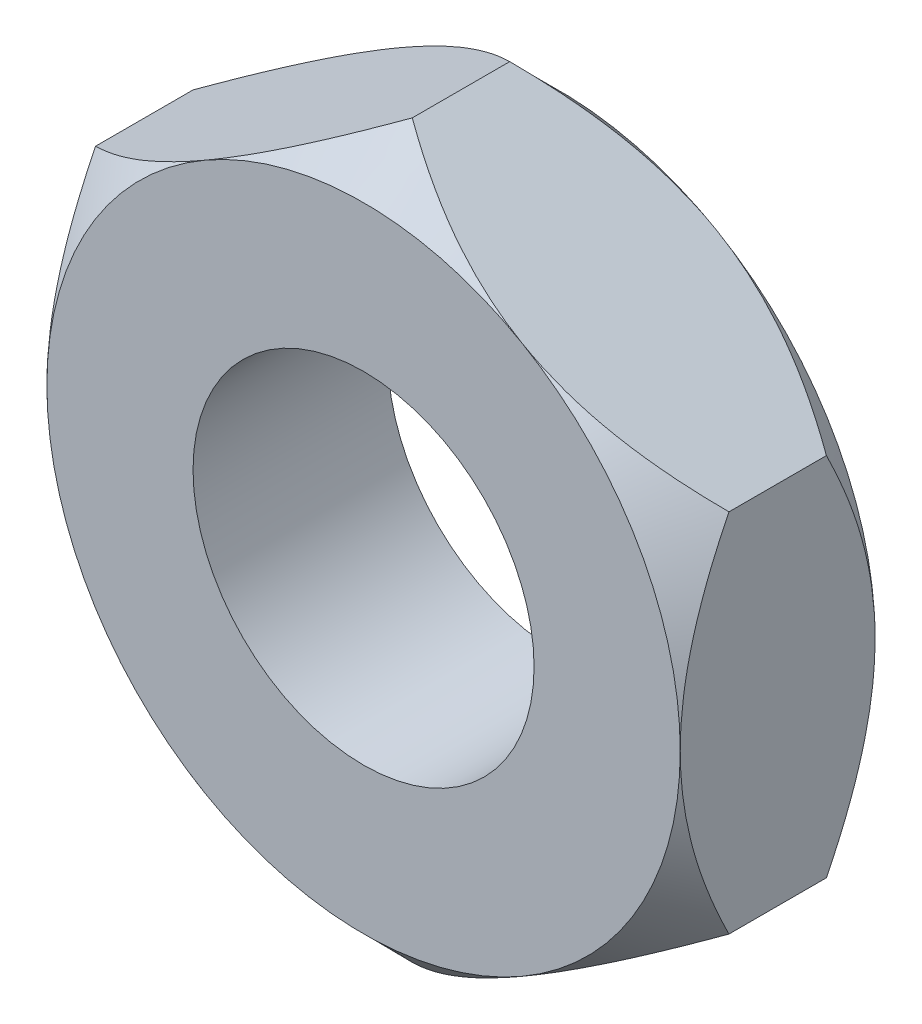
ISO-10303-21;
HEADER;
FILE_DESCRIPTION(('STEP AP214'),'2;1');
FILE_NAME('part.step','',(''),(''),'','','');
FILE_SCHEMA(('AUTOMOTIVE_DESIGN { 1 0 10303 214 1 1 1 1 }'));
ENDSEC;
DATA;
#1=APPLICATION_CONTEXT('core data for automotive mechanical design processes');
#2=APPLICATION_PROTOCOL_DEFINITION('international standard','automotive_design',2000,#1);
#3=PRODUCT_CONTEXT('',#1,'mechanical');
#4=PRODUCT('Part','Part','',(#3));
#5=PRODUCT_RELATED_PRODUCT_CATEGORY('part','',(#4));
#6=PRODUCT_DEFINITION_FORMATION('','',#4);
#7=PRODUCT_DEFINITION_CONTEXT('part definition',#1,'design');
#8=PRODUCT_DEFINITION('design','',#6,#7);
#9=PRODUCT_DEFINITION_SHAPE('','',#8);
#10=(LENGTH_UNIT() NAMED_UNIT(*) SI_UNIT(.MILLI.,.METRE.));
#11=(NAMED_UNIT(*) PLANE_ANGLE_UNIT() SI_UNIT($,.RADIAN.));
#12=(NAMED_UNIT(*) SI_UNIT($,.STERADIAN.) SOLID_ANGLE_UNIT());
#13=UNCERTAINTY_MEASURE_WITH_UNIT(LENGTH_MEASURE(1.E-05),#10,'distance_accuracy_value','');
#14=(GEOMETRIC_REPRESENTATION_CONTEXT(3) GLOBAL_UNCERTAINTY_ASSIGNED_CONTEXT((#13)) GLOBAL_UNIT_ASSIGNED_CONTEXT((#10,
#11,#12)) REPRESENTATION_CONTEXT('',''));
#15=CARTESIAN_POINT('',(0.,0.,0.));
#16=DIRECTION('',(0.,0.,1.));
#17=DIRECTION('',(1.,0.,0.));
#18=AXIS2_PLACEMENT_3D('',#15,#16,#17);
#19=CARTESIAN_POINT('',(6.5,3.75277674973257,2.));
#20=DIRECTION('',(-0.5,-0.866025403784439,0.));
#21=DIRECTION('',(0.866025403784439,-0.5,0.));
#22=AXIS2_PLACEMENT_3D('',#19,#20,#21);
#23=PLANE('',#22);
#24=DIRECTION('',(0.,0.,-1.));
#25=VECTOR('',#24,1.);
#26=CARTESIAN_POINT('',(6.5,3.75277674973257,2.));
#27=LINE('',#26,#25);
#28=CARTESIAN_POINT('',(6.5,3.75277674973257,1.));
#29=VERTEX_POINT('',#28);
#30=CARTESIAN_POINT('',(6.5,3.75277674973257,-1.));
#31=VERTEX_POINT('',#30);
#32=EDGE_CURVE('E275',#29,#31,#27,.T.);
#33=ORIENTED_EDGE('',*,*,#32,.T.);
#34=CARTESIAN_POINT('',(6.5002,3.75266127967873,-0.999885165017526));
#35=CARTESIAN_POINT('',(6.3879001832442,3.81749760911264,-1.06435666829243));
#36=CARTESIAN_POINT('',(6.27474067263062,3.88283028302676,-1.12683571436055));
#37=CARTESIAN_POINT('',(6.04653388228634,4.01458553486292,-1.24720232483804));
#38=CARTESIAN_POINT('',(5.93148560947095,4.0810086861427,-1.30508737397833));
#39=CARTESIAN_POINT('',(5.58219198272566,4.2826734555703,-1.47143225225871));
#40=CARTESIAN_POINT('',(5.34500354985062,4.41961426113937,-1.57187411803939));
#41=CARTESIAN_POINT('',(4.86676947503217,4.69572283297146,-1.74362379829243));
#42=CARTESIAN_POINT('',(4.62584589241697,4.83482012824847,-1.81537119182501));
#43=CARTESIAN_POINT('',(4.26055521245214,5.04572080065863,-1.89809574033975));
#44=CARTESIAN_POINT('',(4.13826265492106,5.11632644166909,-1.92151035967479));
#45=CARTESIAN_POINT('',(3.89266238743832,5.25812382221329,-1.95950957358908));
#46=CARTESIAN_POINT('',(3.76935482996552,5.32931547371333,-1.97409547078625));
#47=CARTESIAN_POINT('',(3.46824490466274,5.50316137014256,-1.99833324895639));
#48=CARTESIAN_POINT('',(3.29012533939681,5.60599874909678,-2.00306042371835));
#49=CARTESIAN_POINT('',(2.93425395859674,5.81146118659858,-1.99306594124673));
#50=CARTESIAN_POINT('',(2.75650229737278,5.91408615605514,-1.97833732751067));
#51=CARTESIAN_POINT('',(2.40271978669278,6.11834258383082,-1.93030561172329));
#52=CARTESIAN_POINT('',(2.22669109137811,6.21997279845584,-1.8969816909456));
#53=CARTESIAN_POINT('',(1.87769250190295,6.42146722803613,-1.81357720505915));
#54=CARTESIAN_POINT('',(1.70472236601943,6.52133158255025,-1.76349797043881));
#55=CARTESIAN_POINT('',(1.40102497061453,6.69667135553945,-1.66178988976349));
#56=CARTESIAN_POINT('',(1.26955769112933,6.77257402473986,-1.61305038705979));
#57=CARTESIAN_POINT('',(1.00892829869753,6.92304847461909,-1.50797082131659));
#58=CARTESIAN_POINT('',(0.879766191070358,6.99762025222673,-1.4516307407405));
#59=CARTESIAN_POINT('',(0.624163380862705,7.14519260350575,-1.33257010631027));
#60=CARTESIAN_POINT('',(0.497715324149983,7.21819742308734,-1.26987043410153));
#61=CARTESIAN_POINT('',(0.247093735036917,7.3628938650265,-1.13886515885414));
#62=CARTESIAN_POINT('',(0.122919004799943,7.43458617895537,-1.07056261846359));
#63=CARTESIAN_POINT('',(-0.000199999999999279,7.50566896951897,-0.999885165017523));
#64=B_SPLINE_CURVE_WITH_KNOTS('',3,(#34,#35,#36,#37,#38,#39,#40,#41,#42,#43,#44,#45,#46,#47,#48,
#49,#50,#51,#52,#53,#54,#55,#56,#57,#58,#59,#60,#61,#62,#63),.UNSPECIFIED.,.F.,.F.,(4,2,2,2,2,2,
2,2,2,2,2,2,2,2,4),(0.,0.434421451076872,0.86907913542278,1.74306808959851,2.60310196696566,
3.03227761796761,3.46138993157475,4.07761355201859,4.69405756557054,5.31119311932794,
5.9282796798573,6.40638297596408,6.88448737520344,7.36106984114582,7.8373935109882),.UNSPECIFIED.);
#65=CARTESIAN_POINT('',(3.25,5.62916512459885,-2.));
#66=VERTEX_POINT('',#65);
#67=EDGE_CURVE('E53',#31,#66,#64,.T.);
#68=ORIENTED_EDGE('',*,*,#67,.T.);
#69=CARTESIAN_POINT('',(0.,7.50555349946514,-1.));
#70=VERTEX_POINT('',#69);
#71=EDGE_CURVE('E268',#66,#70,#64,.T.);
#72=ORIENTED_EDGE('',*,*,#71,.T.);
#73=DIRECTION('',(0.,0.,-1.));
#74=VECTOR('',#73,1.);
#75=CARTESIAN_POINT('',(0.,7.50555349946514,2.));
#76=LINE('',#75,#74);
#77=CARTESIAN_POINT('',(0.,7.50555349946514,1.));
#78=VERTEX_POINT('',#77);
#79=EDGE_CURVE('E147',#78,#70,#76,.T.);
#80=ORIENTED_EDGE('',*,*,#79,.F.);
#81=CARTESIAN_POINT('',(-0.000199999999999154,7.50566896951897,0.999885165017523));
#82=CARTESIAN_POINT('',(0.112099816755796,7.44083264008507,1.06435666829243));
#83=CARTESIAN_POINT('',(0.225259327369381,7.37549996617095,1.12683571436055));
#84=CARTESIAN_POINT('',(0.453466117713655,7.24374471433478,1.24720232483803));
#85=CARTESIAN_POINT('',(0.568514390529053,7.17732156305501,1.30508737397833));
#86=CARTESIAN_POINT('',(0.917808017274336,6.9756567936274,1.47143225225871));
#87=CARTESIAN_POINT('',(1.15499645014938,6.83871598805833,1.57187411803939));
#88=CARTESIAN_POINT('',(1.63323052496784,6.56260741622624,1.74362379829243));
#89=CARTESIAN_POINT('',(1.87415410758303,6.42351012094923,1.81537119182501));
#90=CARTESIAN_POINT('',(2.23944478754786,6.21260944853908,1.89809574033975));
#91=CARTESIAN_POINT('',(2.36173734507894,6.14200380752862,1.9215103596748));
#92=CARTESIAN_POINT('',(2.60733761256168,6.00020642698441,1.95950957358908));
#93=CARTESIAN_POINT('',(2.73064517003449,5.92901477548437,1.97409547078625));
#94=CARTESIAN_POINT('',(3.03175509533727,5.75516887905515,1.99833324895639));
#95=CARTESIAN_POINT('',(3.2098746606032,5.65233150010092,2.00306042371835));
#96=CARTESIAN_POINT('',(3.56574604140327,5.44686906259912,1.99306594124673));
#97=CARTESIAN_POINT('',(3.74349770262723,5.34424409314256,1.97833732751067));
#98=CARTESIAN_POINT('',(4.09728021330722,5.13998766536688,1.93030561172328));
#99=CARTESIAN_POINT('',(4.2733089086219,5.03835745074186,1.8969816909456));
#100=CARTESIAN_POINT('',(4.62230749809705,4.83686302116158,1.81357720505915));
#101=CARTESIAN_POINT('',(4.79527763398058,4.73699866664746,1.76349797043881));
#102=CARTESIAN_POINT('',(5.09897502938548,4.56165889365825,1.66178988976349));
#103=CARTESIAN_POINT('',(5.23044230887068,4.48575622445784,1.61305038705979));
#104=CARTESIAN_POINT('',(5.49107170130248,4.33528177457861,1.50797082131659));
#105=CARTESIAN_POINT('',(5.62023380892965,4.26070999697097,1.4516307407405));
#106=CARTESIAN_POINT('',(5.8758366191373,4.11313764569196,1.33257010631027));
#107=CARTESIAN_POINT('',(6.00228467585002,4.04013282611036,1.26987043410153));
#108=CARTESIAN_POINT('',(6.25290626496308,3.8954363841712,1.13886515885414));
#109=CARTESIAN_POINT('',(6.37708099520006,3.82374407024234,1.0705626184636));
#110=CARTESIAN_POINT('',(6.5002,3.75266127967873,0.999885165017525));
#111=B_SPLINE_CURVE_WITH_KNOTS('',3,(#81,#82,#83,#84,#85,#86,#87,#88,#89,#90,#91,#92,#93,#94,
#95,#96,#97,#98,#99,#100,#101,#102,#103,#104,#105,#106,#107,#108,#109,#110),.UNSPECIFIED.,.F.,
.F.,(4,2,2,2,2,2,2,2,2,2,2,2,2,2,4),(0.,0.434421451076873,0.869079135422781,1.74306808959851,
2.60310196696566,3.03227761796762,3.46138993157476,4.0776135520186,4.69405756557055,
5.31119311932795,5.92827967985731,6.40638297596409,6.88448737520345,7.36106984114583,
7.8373935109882),.UNSPECIFIED.);
#112=CARTESIAN_POINT('',(3.25,5.62916512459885,2.));
#113=VERTEX_POINT('',#112);
#114=EDGE_CURVE('E183',#78,#113,#111,.T.);
#115=ORIENTED_EDGE('',*,*,#114,.T.);
#116=EDGE_CURVE('E191',#113,#29,#111,.T.);
#117=ORIENTED_EDGE('',*,*,#116,.T.);
#118=EDGE_LOOP('',(#33,#68,#72,#80,#115,#117));
#119=FACE_BOUND('',#118,.T.);
#120=ADVANCED_FACE('F31',(#119),#23,.F.);
#121=CARTESIAN_POINT('',(0.,7.50555349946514,2.));
#122=DIRECTION('',(0.5,-0.866025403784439,0.));
#123=DIRECTION('',(0.866025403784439,0.5,0.));
#124=AXIS2_PLACEMENT_3D('',#121,#122,#123);
#125=PLANE('',#124);
#126=ORIENTED_EDGE('',*,*,#79,.T.);
#127=CARTESIAN_POINT('',(0.000200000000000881,7.50566896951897,-0.999885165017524));
#128=CARTESIAN_POINT('',(-0.112099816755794,7.44083264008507,-1.06435666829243));
#129=CARTESIAN_POINT('',(-0.225259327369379,7.37549996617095,-1.12683571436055));
#130=CARTESIAN_POINT('',(-0.453466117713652,7.24374471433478,-1.24720232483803));
#131=CARTESIAN_POINT('',(-0.568514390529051,7.17732156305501,-1.30508737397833));
#132=CARTESIAN_POINT('',(-0.917808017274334,6.9756567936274,-1.4714322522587));
#133=CARTESIAN_POINT('',(-1.15499645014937,6.83871598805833,-1.57187411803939));
#134=CARTESIAN_POINT('',(-1.63323052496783,6.56260741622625,-1.74362379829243));
#135=CARTESIAN_POINT('',(-1.87415410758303,6.42351012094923,-1.81537119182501));
#136=CARTESIAN_POINT('',(-2.23944478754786,6.21260944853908,-1.89809574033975));
#137=CARTESIAN_POINT('',(-2.36173734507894,6.14200380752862,-1.92151035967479));
#138=CARTESIAN_POINT('',(-2.60733761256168,6.00020642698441,-1.95950957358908));
#139=CARTESIAN_POINT('',(-2.73064517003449,5.92901477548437,-1.97409547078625));
#140=CARTESIAN_POINT('',(-3.03175509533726,5.75516887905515,-1.99833324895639));
#141=CARTESIAN_POINT('',(-3.20987466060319,5.65233150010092,-2.00306042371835));
#142=CARTESIAN_POINT('',(-3.56574604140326,5.44686906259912,-1.99306594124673));
#143=CARTESIAN_POINT('',(-3.74349770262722,5.34424409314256,-1.97833732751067));
#144=CARTESIAN_POINT('',(-4.09728021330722,5.13998766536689,-1.93030561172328));
#145=CARTESIAN_POINT('',(-4.27330890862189,5.03835745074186,-1.8969816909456));
#146=CARTESIAN_POINT('',(-4.62230749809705,4.83686302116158,-1.81357720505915));
#147=CARTESIAN_POINT('',(-4.79527763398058,4.73699866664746,-1.76349797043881));
#148=CARTESIAN_POINT('',(-5.09897502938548,4.56165889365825,-1.66178988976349));
#149=CARTESIAN_POINT('',(-5.23044230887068,4.48575622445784,-1.61305038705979));
#150=CARTESIAN_POINT('',(-5.49107170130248,4.33528177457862,-1.50797082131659));
#151=CARTESIAN_POINT('',(-5.62023380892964,4.26070999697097,-1.4516307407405));
#152=CARTESIAN_POINT('',(-5.8758366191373,4.11313764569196,-1.33257010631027));
#153=CARTESIAN_POINT('',(-6.00228467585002,4.04013282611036,-1.26987043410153));
#154=CARTESIAN_POINT('',(-6.25290626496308,3.8954363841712,-1.13886515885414));
#155=CARTESIAN_POINT('',(-6.37708099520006,3.82374407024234,-1.0705626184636));
#156=CARTESIAN_POINT('',(-6.5002,3.75266127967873,-0.999885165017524));
#157=B_SPLINE_CURVE_WITH_KNOTS('',3,(#127,#128,#129,#130,#131,#132,#133,#134,#135,#136,#137,
#138,#139,#140,#141,#142,#143,#144,#145,#146,#147,#148,#149,#150,#151,#152,#153,#154,#155,#156),
.UNSPECIFIED.,.F.,.F.,(4,2,2,2,2,2,2,2,2,2,2,2,2,2,4),(0.,0.434421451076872,0.869079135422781,
1.74306808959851,2.60310196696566,3.03227761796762,3.46138993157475,4.0776135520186,
4.69405756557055,5.31119311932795,5.92827967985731,6.40638297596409,6.88448737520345,
7.36106984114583,7.8373935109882),.UNSPECIFIED.);
#158=CARTESIAN_POINT('',(-3.25,5.62916512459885,-2.));
#159=VERTEX_POINT('',#158);
#160=EDGE_CURVE('E141',#70,#159,#157,.T.);
#161=ORIENTED_EDGE('',*,*,#160,.T.);
#162=CARTESIAN_POINT('',(-6.5,3.75277674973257,-1.));
#163=VERTEX_POINT('',#162);
#164=EDGE_CURVE('E124',#159,#163,#157,.T.);
#165=ORIENTED_EDGE('',*,*,#164,.T.);
#166=DIRECTION('',(0.,0.,-1.));
#167=VECTOR('',#166,1.);
#168=CARTESIAN_POINT('',(-6.5,3.75277674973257,2.));
#169=LINE('',#168,#167);
#170=CARTESIAN_POINT('',(-6.5,3.75277674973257,1.));
#171=VERTEX_POINT('',#170);
#172=EDGE_CURVE('E140',#171,#163,#169,.T.);
#173=ORIENTED_EDGE('',*,*,#172,.F.);
#174=CARTESIAN_POINT('',(-6.5002,3.75266127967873,0.999885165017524));
#175=CARTESIAN_POINT('',(-6.3879001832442,3.81749760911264,1.06435666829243));
#176=CARTESIAN_POINT('',(-6.27474067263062,3.88283028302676,1.12683571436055));
#177=CARTESIAN_POINT('',(-6.04653388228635,4.01458553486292,1.24720232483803));
#178=CARTESIAN_POINT('',(-5.93148560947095,4.08100868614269,1.30508737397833));
#179=CARTESIAN_POINT('',(-5.58219198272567,4.2826734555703,1.47143225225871));
#180=CARTESIAN_POINT('',(-5.34500354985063,4.41961426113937,1.57187411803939));
#181=CARTESIAN_POINT('',(-4.86676947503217,4.69572283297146,1.74362379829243));
#182=CARTESIAN_POINT('',(-4.62584589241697,4.83482012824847,1.81537119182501));
#183=CARTESIAN_POINT('',(-4.26055521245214,5.04572080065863,1.89809574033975));
#184=CARTESIAN_POINT('',(-4.13826265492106,5.11632644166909,1.9215103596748));
#185=CARTESIAN_POINT('',(-3.89266238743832,5.25812382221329,1.95950957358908));
#186=CARTESIAN_POINT('',(-3.76935482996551,5.32931547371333,1.97409547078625));
#187=CARTESIAN_POINT('',(-3.46824490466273,5.50316137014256,1.99833324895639));
#188=CARTESIAN_POINT('',(-3.2901253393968,5.60599874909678,2.00306042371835));
#189=CARTESIAN_POINT('',(-2.93425395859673,5.81146118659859,1.99306594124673));
#190=CARTESIAN_POINT('',(-2.75650229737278,5.91408615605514,1.97833732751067));
#191=CARTESIAN_POINT('',(-2.40271978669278,6.11834258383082,1.93030561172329));
#192=CARTESIAN_POINT('',(-2.2266910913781,6.21997279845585,1.8969816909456));
#193=CARTESIAN_POINT('',(-1.87769250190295,6.42146722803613,1.81357720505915));
#194=CARTESIAN_POINT('',(-1.70472236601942,6.52133158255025,1.76349797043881));
#195=CARTESIAN_POINT('',(-1.40102497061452,6.69667135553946,1.66178988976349));
#196=CARTESIAN_POINT('',(-1.26955769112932,6.77257402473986,1.61305038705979));
#197=CARTESIAN_POINT('',(-1.00892829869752,6.92304847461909,1.50797082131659));
#198=CARTESIAN_POINT('',(-0.879766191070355,6.99762025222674,1.4516307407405));
#199=CARTESIAN_POINT('',(-0.624163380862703,7.14519260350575,1.33257010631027));
#200=CARTESIAN_POINT('',(-0.497715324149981,7.21819742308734,1.26987043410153));
#201=CARTESIAN_POINT('',(-0.247093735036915,7.3628938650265,1.13886515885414));
#202=CARTESIAN_POINT('',(-0.122919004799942,7.43458617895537,1.0705626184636));
#203=CARTESIAN_POINT('',(0.000200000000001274,7.50566896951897,0.999885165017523));
#204=B_SPLINE_CURVE_WITH_KNOTS('',3,(#174,#175,#176,#177,#178,#179,#180,#181,#182,#183,#184,
#185,#186,#187,#188,#189,#190,#191,#192,#193,#194,#195,#196,#197,#198,#199,#200,#201,#202,#203),
.UNSPECIFIED.,.F.,.F.,(4,2,2,2,2,2,2,2,2,2,2,2,2,2,4),(0.,0.434421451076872,0.86907913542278,
1.74306808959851,2.60310196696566,3.03227761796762,3.46138993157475,4.0776135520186,
4.69405756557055,5.31119311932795,5.92827967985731,6.40638297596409,6.88448737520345,
7.36106984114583,7.8373935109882),.UNSPECIFIED.);
#205=CARTESIAN_POINT('',(-3.25,5.62916512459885,2.));
#206=VERTEX_POINT('',#205);
#207=EDGE_CURVE('E250',#171,#206,#204,.T.);
#208=ORIENTED_EDGE('',*,*,#207,.T.);
#209=EDGE_CURVE('E185',#206,#78,#204,.T.);
#210=ORIENTED_EDGE('',*,*,#209,.T.);
#211=EDGE_LOOP('',(#126,#161,#165,#173,#208,#210));
#212=FACE_BOUND('',#211,.T.);
#213=ADVANCED_FACE('F138',(#212),#125,.F.);
#214=CARTESIAN_POINT('',(-6.5,3.75277674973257,2.));
#215=DIRECTION('',(1.,0.,0.));
#216=DIRECTION('',(0.,0.,-1.));
#217=AXIS2_PLACEMENT_3D('',#214,#215,#216);
#218=PLANE('',#217);
#219=ORIENTED_EDGE('',*,*,#172,.T.);
#220=CARTESIAN_POINT('',(-6.5,-7.84762752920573,1.66957966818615));
#221=CARTESIAN_POINT('',(-6.5,-7.65771219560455,1.52416000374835));
#222=CARTESIAN_POINT('',(-6.5,-7.46678035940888,1.38004698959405));
#223=CARTESIAN_POINT('',(-6.5,-7.08246758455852,1.09503196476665));
#224=CARTESIAN_POINT('',(-6.5,-6.88908607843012,0.954130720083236));
#225=CARTESIAN_POINT('',(-6.5,-6.49804934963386,0.67513753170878));
#226=CARTESIAN_POINT('',(-6.5,-6.30037269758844,0.537075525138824));
#227=CARTESIAN_POINT('',(-6.5,-5.90174946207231,0.265771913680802));
#228=CARTESIAN_POINT('',(-6.5,-5.70080310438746,0.13252997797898));
#229=CARTESIAN_POINT('',(-6.5,-5.28229584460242,-0.136252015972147));
#230=CARTESIAN_POINT('',(-6.5,-5.0644863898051,-0.271407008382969));
#231=CARTESIAN_POINT('',(-6.5,-4.62378439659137,-0.533300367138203));
#232=CARTESIAN_POINT('',(-6.5,-4.40089101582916,-0.660037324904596));
#233=CARTESIAN_POINT('',(-6.5,-3.94996330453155,-0.902390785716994));
#234=CARTESIAN_POINT('',(-6.5,-3.72194658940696,-1.01803980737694));
#235=CARTESIAN_POINT('',(-6.5,-3.25951036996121,-1.23561766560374));
#236=CARTESIAN_POINT('',(-6.5,-3.02509393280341,-1.33755294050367));
#237=CARTESIAN_POINT('',(-6.5,-2.57217264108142,-1.51505823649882));
#238=CARTESIAN_POINT('',(-6.5,-2.35429778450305,-1.59221921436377));
#239=CARTESIAN_POINT('',(-6.5,-1.91302782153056,-1.72907695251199));
#240=CARTESIAN_POINT('',(-6.5,-1.68963238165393,-1.788772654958));
#241=CARTESIAN_POINT('',(-6.5,-1.24255222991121,-1.88645277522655));
#242=CARTESIAN_POINT('',(-6.5,-1.01895512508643,-1.92483138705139));
#243=CARTESIAN_POINT('',(-6.5,-0.56903124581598,-1.97907291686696));
#244=CARTESIAN_POINT('',(-6.5,-0.342705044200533,-1.99494047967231));
#245=CARTESIAN_POINT('',(-6.5,0.100240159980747,-2.00281493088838));
#246=CARTESIAN_POINT('',(-6.5,0.316841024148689,-1.99585632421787));
#247=CARTESIAN_POINT('',(-6.5,0.74831610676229,-1.9608203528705));
#248=CARTESIAN_POINT('',(-6.5,0.963190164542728,-1.93274104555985));
#249=CARTESIAN_POINT('',(-6.5,1.39333005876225,-1.85657178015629));
#250=CARTESIAN_POINT('',(-6.5,1.60853208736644,-1.8081275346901));
#251=CARTESIAN_POINT('',(-6.5,2.03419827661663,-1.69391623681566));
#252=CARTESIAN_POINT('',(-6.5,2.24466272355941,-1.62815023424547));
#253=CARTESIAN_POINT('',(-6.5,2.67496760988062,-1.47708595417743));
#254=CARTESIAN_POINT('',(-6.5,2.89443797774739,-1.39074519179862));
#255=CARTESIAN_POINT('',(-6.5,3.32770458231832,-1.20473169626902));
#256=CARTESIAN_POINT('',(-6.5,3.54149815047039,-1.10505282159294));
#257=CARTESIAN_POINT('',(-6.5,3.96444622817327,-0.894752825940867));
#258=CARTESIAN_POINT('',(-6.5,4.17358364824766,-0.784097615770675));
#259=CARTESIAN_POINT('',(-6.5,4.58706793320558,-0.554299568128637));
#260=CARTESIAN_POINT('',(-6.5,4.7914155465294,-0.435158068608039));
#261=CARTESIAN_POINT('',(-6.5,5.18581138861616,-0.196207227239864));
#262=CARTESIAN_POINT('',(-6.5,5.37606267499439,-0.0767312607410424));
#263=CARTESIAN_POINT('',(-6.5,5.753317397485,0.167257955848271));
#264=CARTESIAN_POINT('',(-6.5,5.94032058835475,0.291771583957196));
#265=CARTESIAN_POINT('',(-6.5,6.30999252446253,0.543908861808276));
#266=CARTESIAN_POINT('',(-6.5,6.49268411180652,0.671499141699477));
#267=CARTESIAN_POINT('',(-6.5,6.85558623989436,0.93006071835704));
#268=CARTESIAN_POINT('',(-6.5,7.03579744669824,1.06103107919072));
#269=CARTESIAN_POINT('',(-6.5,7.2149704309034,1.19338280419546));
#270=B_SPLINE_CURVE_WITH_KNOTS('',3,(#220,#221,#222,#223,#224,#225,#226,#227,#228,#229,#230,
#231,#232,#233,#234,#235,#236,#237,#238,#239,#240,#241,#242,#243,#244,#245,#246,#247,#248,#249,
#250,#251,#252,#253,#254,#255,#256,#257,#258,#259,#260,#261,#262,#263,#264,#265,#266,#267,#268,
#269),.UNSPECIFIED.,.F.,.F.,(4,2,2,2,2,2,2,2,2,2,2,2,2,2,2,2,2,2,2,2,2,2,2,2,4),(0.,
0.717601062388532,1.43537151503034,2.15866180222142,2.88190235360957,3.65075745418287,
4.41974088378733,5.18639524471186,5.95268841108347,6.64549313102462,7.33833980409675,
8.01790723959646,8.69733443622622,9.34640220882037,9.99552968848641,10.656450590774,
11.3173314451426,12.0243128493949,12.7316209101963,13.4411988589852,14.1506651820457,
14.8245383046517,15.4984620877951,16.1669258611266,16.8352064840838),.UNSPECIFIED.);
#271=CARTESIAN_POINT('',(-6.5,0.,-2.));
#272=VERTEX_POINT('',#271);
#273=EDGE_CURVE('E121',#163,#272,#270,.F.);
#274=ORIENTED_EDGE('',*,*,#273,.T.);
#275=CARTESIAN_POINT('',(-6.5,-3.75277674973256,-1.));
#276=VERTEX_POINT('',#275);
#277=EDGE_CURVE('E132',#272,#276,#270,.F.);
#278=ORIENTED_EDGE('',*,*,#277,.T.);
#279=DIRECTION('',(0.,0.,-1.));
#280=VECTOR('',#279,1.);
#281=CARTESIAN_POINT('',(-6.5,-3.75277674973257,2.));
#282=LINE('',#281,#280);
#283=CARTESIAN_POINT('',(-6.5,-3.75277674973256,1.));
#284=VERTEX_POINT('',#283);
#285=EDGE_CURVE('E148',#284,#276,#282,.T.);
#286=ORIENTED_EDGE('',*,*,#285,.F.);
#287=CARTESIAN_POINT('',(-6.5,-7.84762752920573,-1.66957966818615));
#288=CARTESIAN_POINT('',(-6.5,-7.65771219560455,-1.52416000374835));
#289=CARTESIAN_POINT('',(-6.5,-7.46678035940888,-1.38004698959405));
#290=CARTESIAN_POINT('',(-6.5,-7.08246758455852,-1.09503196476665));
#291=CARTESIAN_POINT('',(-6.5,-6.88908607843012,-0.954130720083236));
#292=CARTESIAN_POINT('',(-6.5,-6.49804934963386,-0.67513753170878));
#293=CARTESIAN_POINT('',(-6.5,-6.30037269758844,-0.537075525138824));
#294=CARTESIAN_POINT('',(-6.5,-5.90174946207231,-0.265771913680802));
#295=CARTESIAN_POINT('',(-6.5,-5.70080310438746,-0.13252997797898));
#296=CARTESIAN_POINT('',(-6.5,-5.28229584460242,0.136252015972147));
#297=CARTESIAN_POINT('',(-6.5,-5.0644863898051,0.271407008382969));
#298=CARTESIAN_POINT('',(-6.5,-4.62378439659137,0.533300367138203));
#299=CARTESIAN_POINT('',(-6.5,-4.40089101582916,0.660037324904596));
#300=CARTESIAN_POINT('',(-6.5,-3.94996330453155,0.902390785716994));
#301=CARTESIAN_POINT('',(-6.5,-3.72194658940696,1.01803980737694));
#302=CARTESIAN_POINT('',(-6.5,-3.25951036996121,1.23561766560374));
#303=CARTESIAN_POINT('',(-6.5,-3.02509393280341,1.33755294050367));
#304=CARTESIAN_POINT('',(-6.5,-2.57217264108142,1.51505823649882));
#305=CARTESIAN_POINT('',(-6.5,-2.35429778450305,1.59221921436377));
#306=CARTESIAN_POINT('',(-6.5,-1.91302782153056,1.72907695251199));
#307=CARTESIAN_POINT('',(-6.5,-1.68963238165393,1.788772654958));
#308=CARTESIAN_POINT('',(-6.5,-1.24255222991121,1.88645277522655));
#309=CARTESIAN_POINT('',(-6.5,-1.01895512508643,1.92483138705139));
#310=CARTESIAN_POINT('',(-6.5,-0.56903124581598,1.97907291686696));
#311=CARTESIAN_POINT('',(-6.5,-0.342705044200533,1.99494047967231));
#312=CARTESIAN_POINT('',(-6.5,0.100240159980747,2.00281493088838));
#313=CARTESIAN_POINT('',(-6.5,0.316841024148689,1.99585632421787));
#314=CARTESIAN_POINT('',(-6.5,0.74831610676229,1.9608203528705));
#315=CARTESIAN_POINT('',(-6.5,0.963190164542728,1.93274104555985));
#316=CARTESIAN_POINT('',(-6.5,1.39333005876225,1.85657178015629));
#317=CARTESIAN_POINT('',(-6.5,1.60853208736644,1.8081275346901));
#318=CARTESIAN_POINT('',(-6.5,2.03419827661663,1.69391623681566));
#319=CARTESIAN_POINT('',(-6.5,2.24466272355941,1.62815023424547));
#320=CARTESIAN_POINT('',(-6.5,2.67496760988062,1.47708595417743));
#321=CARTESIAN_POINT('',(-6.5,2.89443797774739,1.39074519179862));
#322=CARTESIAN_POINT('',(-6.5,3.32770458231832,1.20473169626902));
#323=CARTESIAN_POINT('',(-6.5,3.54149815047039,1.10505282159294));
#324=CARTESIAN_POINT('',(-6.5,3.96444622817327,0.894752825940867));
#325=CARTESIAN_POINT('',(-6.5,4.17358364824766,0.784097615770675));
#326=CARTESIAN_POINT('',(-6.5,4.58706793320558,0.554299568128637));
#327=CARTESIAN_POINT('',(-6.5,4.7914155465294,0.435158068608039));
#328=CARTESIAN_POINT('',(-6.5,5.18581138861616,0.196207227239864));
#329=CARTESIAN_POINT('',(-6.5,5.37606267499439,0.0767312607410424));
#330=CARTESIAN_POINT('',(-6.5,5.753317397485,-0.167257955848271));
#331=CARTESIAN_POINT('',(-6.5,5.94032058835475,-0.291771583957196));
#332=CARTESIAN_POINT('',(-6.5,6.30999252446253,-0.543908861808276));
#333=CARTESIAN_POINT('',(-6.5,6.49268411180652,-0.671499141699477));
#334=CARTESIAN_POINT('',(-6.5,6.85558623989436,-0.93006071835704));
#335=CARTESIAN_POINT('',(-6.5,7.03579744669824,-1.06103107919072));
#336=CARTESIAN_POINT('',(-6.5,7.2149704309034,-1.19338280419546));
#337=B_SPLINE_CURVE_WITH_KNOTS('',3,(#287,#288,#289,#290,#291,#292,#293,#294,#295,#296,#297,
#298,#299,#300,#301,#302,#303,#304,#305,#306,#307,#308,#309,#310,#311,#312,#313,#314,#315,#316,
#317,#318,#319,#320,#321,#322,#323,#324,#325,#326,#327,#328,#329,#330,#331,#332,#333,#334,#335,
#336),.UNSPECIFIED.,.F.,.F.,(4,2,2,2,2,2,2,2,2,2,2,2,2,2,2,2,2,2,2,2,2,2,2,2,4),(0.,
0.717601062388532,1.43537151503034,2.15866180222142,2.88190235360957,3.65075745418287,
4.41974088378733,5.18639524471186,5.95268841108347,6.64549313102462,7.33833980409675,
8.01790723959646,8.69733443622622,9.34640220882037,9.99552968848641,10.656450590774,
11.3173314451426,12.0243128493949,12.7316209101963,13.4411988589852,14.1506651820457,
14.8245383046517,15.4984620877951,16.1669258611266,16.8352064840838),.UNSPECIFIED.);
#338=CARTESIAN_POINT('',(-6.5,0.,2.));
#339=VERTEX_POINT('',#338);
#340=EDGE_CURVE('E278',#284,#339,#337,.T.);
#341=ORIENTED_EDGE('',*,*,#340,.T.);
#342=EDGE_CURVE('E146',#339,#171,#337,.T.);
#343=ORIENTED_EDGE('',*,*,#342,.T.);
#344=EDGE_LOOP('',(#219,#274,#278,#286,#341,#343));
#345=FACE_BOUND('',#344,.T.);
#346=ADVANCED_FACE('F144',(#345),#218,.F.);
#347=CARTESIAN_POINT('',(-6.5,-3.75277674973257,2.));
#348=DIRECTION('',(0.5,0.866025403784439,0.));
#349=DIRECTION('',(-0.866025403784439,0.5,0.));
#350=AXIS2_PLACEMENT_3D('',#347,#348,#349);
#351=PLANE('',#350);
#352=ORIENTED_EDGE('',*,*,#285,.T.);
#353=CARTESIAN_POINT('',(-6.5002,-3.75266127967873,-0.999885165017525));
#354=CARTESIAN_POINT('',(-6.38790018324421,-3.81749760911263,-1.06435666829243));
#355=CARTESIAN_POINT('',(-6.27474067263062,-3.88283028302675,-1.12683571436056));
#356=CARTESIAN_POINT('',(-6.04653388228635,-4.01458553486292,-1.24720232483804));
#357=CARTESIAN_POINT('',(-5.93148560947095,-4.08100868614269,-1.30508737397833));
#358=CARTESIAN_POINT('',(-5.58219198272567,-4.2826734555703,-1.47143225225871));
#359=CARTESIAN_POINT('',(-5.34500354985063,-4.41961426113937,-1.57187411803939));
#360=CARTESIAN_POINT('',(-4.86676947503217,-4.69572283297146,-1.74362379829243));
#361=CARTESIAN_POINT('',(-4.62584589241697,-4.83482012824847,-1.81537119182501));
#362=CARTESIAN_POINT('',(-4.26055521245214,-5.04572080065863,-1.89809574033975));
#363=CARTESIAN_POINT('',(-4.13826265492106,-5.11632644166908,-1.9215103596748));
#364=CARTESIAN_POINT('',(-3.89266238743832,-5.25812382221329,-1.95950957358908));
#365=CARTESIAN_POINT('',(-3.76935482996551,-5.32931547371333,-1.97409547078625));
#366=CARTESIAN_POINT('',(-3.46824490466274,-5.50316137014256,-1.9983332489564));
#367=CARTESIAN_POINT('',(-3.29012533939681,-5.60599874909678,-2.00306042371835));
#368=CARTESIAN_POINT('',(-2.93425395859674,-5.81146118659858,-1.99306594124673));
#369=CARTESIAN_POINT('',(-2.75650229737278,-5.91408615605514,-1.97833732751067));
#370=CARTESIAN_POINT('',(-2.40271978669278,-6.11834258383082,-1.93030561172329));
#371=CARTESIAN_POINT('',(-2.22669109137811,-6.21997279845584,-1.8969816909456));
#372=CARTESIAN_POINT('',(-1.87769250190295,-6.42146722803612,-1.81357720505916));
#373=CARTESIAN_POINT('',(-1.70472236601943,-6.52133158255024,-1.76349797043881));
#374=CARTESIAN_POINT('',(-1.40102497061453,-6.69667135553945,-1.66178988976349));
#375=CARTESIAN_POINT('',(-1.26955769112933,-6.77257402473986,-1.61305038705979));
#376=CARTESIAN_POINT('',(-1.00892829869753,-6.92304847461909,-1.5079708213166));
#377=CARTESIAN_POINT('',(-0.879766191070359,-6.99762025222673,-1.4516307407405));
#378=CARTESIAN_POINT('',(-0.624163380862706,-7.14519260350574,-1.33257010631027));
#379=CARTESIAN_POINT('',(-0.497715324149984,-7.21819742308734,-1.26987043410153));
#380=CARTESIAN_POINT('',(-0.247093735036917,-7.3628938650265,-1.13886515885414));
#381=CARTESIAN_POINT('',(-0.122919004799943,-7.43458617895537,-1.0705626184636));
#382=CARTESIAN_POINT('',(0.000199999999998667,-7.50566896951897,-0.999885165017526));
#383=B_SPLINE_CURVE_WITH_KNOTS('',3,(#353,#354,#355,#356,#357,#358,#359,#360,#361,#362,#363,
#364,#365,#366,#367,#368,#369,#370,#371,#372,#373,#374,#375,#376,#377,#378,#379,#380,#381,#382),
.UNSPECIFIED.,.F.,.F.,(4,2,2,2,2,2,2,2,2,2,2,2,2,2,4),(0.,0.434421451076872,0.86907913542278,
1.74306808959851,2.60310196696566,3.03227761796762,3.46138993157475,4.0776135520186,
4.69405756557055,5.31119311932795,5.9282796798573,6.40638297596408,6.88448737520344,
7.36106984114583,7.8373935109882),.UNSPECIFIED.);
#384=CARTESIAN_POINT('',(-3.25,-5.62916512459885,-2.));
#385=VERTEX_POINT('',#384);
#386=EDGE_CURVE('E296',#276,#385,#383,.T.);
#387=ORIENTED_EDGE('',*,*,#386,.T.);
#388=CARTESIAN_POINT('',(0.,-7.50555349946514,-1.));
#389=VERTEX_POINT('',#388);
#390=EDGE_CURVE('E295',#385,#389,#383,.T.);
#391=ORIENTED_EDGE('',*,*,#390,.T.);
#392=DIRECTION('',(0.,0.,-1.));
#393=VECTOR('',#392,1.);
#394=CARTESIAN_POINT('',(0.,-7.50555349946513,2.));
#395=LINE('',#394,#393);
#396=CARTESIAN_POINT('',(0.,-7.50555349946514,1.));
#397=VERTEX_POINT('',#396);
#398=EDGE_CURVE('E153',#397,#389,#395,.T.);
#399=ORIENTED_EDGE('',*,*,#398,.F.);
#400=CARTESIAN_POINT('',(0.000199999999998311,-7.50566896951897,0.999885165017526));
#401=CARTESIAN_POINT('',(-0.112099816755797,-7.44083264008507,1.06435666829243));
#402=CARTESIAN_POINT('',(-0.225259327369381,-7.37549996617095,1.12683571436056));
#403=CARTESIAN_POINT('',(-0.453466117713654,-7.24374471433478,1.24720232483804));
#404=CARTESIAN_POINT('',(-0.568514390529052,-7.17732156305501,1.30508737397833));
#405=CARTESIAN_POINT('',(-0.917808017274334,-6.9756567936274,1.47143225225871));
#406=CARTESIAN_POINT('',(-1.15499645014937,-6.83871598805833,1.57187411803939));
#407=CARTESIAN_POINT('',(-1.63323052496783,-6.56260741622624,1.74362379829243));
#408=CARTESIAN_POINT('',(-1.87415410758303,-6.42351012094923,1.81537119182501));
#409=CARTESIAN_POINT('',(-2.23944478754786,-6.21260944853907,1.89809574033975));
#410=CARTESIAN_POINT('',(-2.36173734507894,-6.14200380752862,1.9215103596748));
#411=CARTESIAN_POINT('',(-2.60733761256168,-6.00020642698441,1.95950957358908));
#412=CARTESIAN_POINT('',(-2.73064517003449,-5.92901477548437,1.97409547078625));
#413=CARTESIAN_POINT('',(-3.03175509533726,-5.75516887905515,1.9983332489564));
#414=CARTESIAN_POINT('',(-3.20987466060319,-5.65233150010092,2.00306042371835));
#415=CARTESIAN_POINT('',(-3.56574604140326,-5.44686906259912,1.99306594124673));
#416=CARTESIAN_POINT('',(-3.74349770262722,-5.34424409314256,1.97833732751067));
#417=CARTESIAN_POINT('',(-4.09728021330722,-5.13998766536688,1.93030561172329));
#418=CARTESIAN_POINT('',(-4.27330890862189,-5.03835745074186,1.8969816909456));
#419=CARTESIAN_POINT('',(-4.62230749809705,-4.83686302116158,1.81357720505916));
#420=CARTESIAN_POINT('',(-4.79527763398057,-4.73699866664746,1.76349797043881));
#421=CARTESIAN_POINT('',(-5.09897502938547,-4.56165889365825,1.66178988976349));
#422=CARTESIAN_POINT('',(-5.23044230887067,-4.48575622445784,1.61305038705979));
#423=CARTESIAN_POINT('',(-5.49107170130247,-4.33528177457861,1.5079708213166));
#424=CARTESIAN_POINT('',(-5.62023380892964,-4.26070999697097,1.4516307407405));
#425=CARTESIAN_POINT('',(-5.87583661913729,-4.11313764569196,1.33257010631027));
#426=CARTESIAN_POINT('',(-6.00228467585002,-4.04013282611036,1.26987043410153));
#427=CARTESIAN_POINT('',(-6.25290626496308,-3.8954363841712,1.13886515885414));
#428=CARTESIAN_POINT('',(-6.37708099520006,-3.82374407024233,1.0705626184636));
#429=CARTESIAN_POINT('',(-6.5002,-3.75266127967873,0.999885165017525));
#430=B_SPLINE_CURVE_WITH_KNOTS('',3,(#400,#401,#402,#403,#404,#405,#406,#407,#408,#409,#410,
#411,#412,#413,#414,#415,#416,#417,#418,#419,#420,#421,#422,#423,#424,#425,#426,#427,#428,#429),
.UNSPECIFIED.,.F.,.F.,(4,2,2,2,2,2,2,2,2,2,2,2,2,2,4),(0.,0.434421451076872,0.869079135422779,
1.74306808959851,2.60310196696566,3.03227761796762,3.46138993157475,4.0776135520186,
4.69405756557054,5.31119311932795,5.9282796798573,6.40638297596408,6.88448737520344,
7.36106984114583,7.8373935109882),.UNSPECIFIED.);
#431=CARTESIAN_POINT('',(-3.25,-5.62916512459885,2.));
#432=VERTEX_POINT('',#431);
#433=EDGE_CURVE('E205',#397,#432,#430,.T.);
#434=ORIENTED_EDGE('',*,*,#433,.T.);
#435=EDGE_CURVE('E486',#432,#284,#430,.T.);
#436=ORIENTED_EDGE('',*,*,#435,.T.);
#437=EDGE_LOOP('',(#352,#387,#391,#399,#434,#436));
#438=FACE_BOUND('',#437,.T.);
#439=ADVANCED_FACE('F292',(#438),#351,.F.);
#440=CARTESIAN_POINT('',(0.,-7.50555349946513,2.));
#441=DIRECTION('',(-0.5,0.866025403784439,0.));
#442=DIRECTION('',(-0.866025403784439,-0.5,0.));
#443=AXIS2_PLACEMENT_3D('',#440,#441,#442);
#444=PLANE('',#443);
#445=ORIENTED_EDGE('',*,*,#398,.T.);
#446=CARTESIAN_POINT('',(-0.000200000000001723,-7.50566896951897,-0.999885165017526));
#447=CARTESIAN_POINT('',(0.112099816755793,-7.44083264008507,-1.06435666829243));
#448=CARTESIAN_POINT('',(0.225259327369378,-7.37549996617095,-1.12683571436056));
#449=CARTESIAN_POINT('',(0.453466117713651,-7.24374471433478,-1.24720232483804));
#450=CARTESIAN_POINT('',(0.56851439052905,-7.17732156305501,-1.30508737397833));
#451=CARTESIAN_POINT('',(0.917808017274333,-6.9756567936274,-1.47143225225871));
#452=CARTESIAN_POINT('',(1.15499645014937,-6.83871598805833,-1.57187411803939));
#453=CARTESIAN_POINT('',(1.63323052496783,-6.56260741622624,-1.74362379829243));
#454=CARTESIAN_POINT('',(1.87415410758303,-6.42351012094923,-1.81537119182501));
#455=CARTESIAN_POINT('',(2.23944478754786,-6.21260944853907,-1.89809574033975));
#456=CARTESIAN_POINT('',(2.36173734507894,-6.14200380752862,-1.9215103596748));
#457=CARTESIAN_POINT('',(2.60733761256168,-6.00020642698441,-1.95950957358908));
#458=CARTESIAN_POINT('',(2.73064517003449,-5.92901477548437,-1.97409547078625));
#459=CARTESIAN_POINT('',(3.03175509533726,-5.75516887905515,-1.9983332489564));
#460=CARTESIAN_POINT('',(3.20987466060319,-5.65233150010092,-2.00306042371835));
#461=CARTESIAN_POINT('',(3.56574604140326,-5.44686906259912,-1.99306594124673));
#462=CARTESIAN_POINT('',(3.74349770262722,-5.34424409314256,-1.97833732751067));
#463=CARTESIAN_POINT('',(4.09728021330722,-5.13998766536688,-1.93030561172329));
#464=CARTESIAN_POINT('',(4.27330890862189,-5.03835745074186,-1.8969816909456));
#465=CARTESIAN_POINT('',(4.62230749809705,-4.83686302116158,-1.81357720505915));
#466=CARTESIAN_POINT('',(4.79527763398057,-4.73699866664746,-1.76349797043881));
#467=CARTESIAN_POINT('',(5.09897502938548,-4.56165889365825,-1.66178988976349));
#468=CARTESIAN_POINT('',(5.23044230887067,-4.48575622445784,-1.61305038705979));
#469=CARTESIAN_POINT('',(5.49107170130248,-4.33528177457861,-1.50797082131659));
#470=CARTESIAN_POINT('',(5.62023380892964,-4.26070999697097,-1.4516307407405));
#471=CARTESIAN_POINT('',(5.87583661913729,-4.11313764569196,-1.33257010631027));
#472=CARTESIAN_POINT('',(6.00228467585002,-4.04013282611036,-1.26987043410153));
#473=CARTESIAN_POINT('',(6.25290626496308,-3.8954363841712,-1.13886515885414));
#474=CARTESIAN_POINT('',(6.37708099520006,-3.82374407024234,-1.0705626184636));
#475=CARTESIAN_POINT('',(6.5002,-3.75266127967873,-0.999885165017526));
#476=B_SPLINE_CURVE_WITH_KNOTS('',3,(#446,#447,#448,#449,#450,#451,#452,#453,#454,#455,#456,
#457,#458,#459,#460,#461,#462,#463,#464,#465,#466,#467,#468,#469,#470,#471,#472,#473,#474,#475),
.UNSPECIFIED.,.F.,.F.,(4,2,2,2,2,2,2,2,2,2,2,2,2,2,4),(0.,0.434421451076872,0.86907913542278,
1.74306808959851,2.60310196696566,3.03227761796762,3.46138993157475,4.0776135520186,
4.69405756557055,5.31119311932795,5.92827967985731,6.40638297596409,6.88448737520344,
7.36106984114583,7.8373935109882),.UNSPECIFIED.);
#477=CARTESIAN_POINT('',(3.25,-5.62916512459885,-2.));
#478=VERTEX_POINT('',#477);
#479=EDGE_CURVE('E287',#389,#478,#476,.T.);
#480=ORIENTED_EDGE('',*,*,#479,.T.);
#481=CARTESIAN_POINT('',(6.5,-3.75277674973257,-1.));
#482=VERTEX_POINT('',#481);
#483=EDGE_CURVE('E300',#478,#482,#476,.T.);
#484=ORIENTED_EDGE('',*,*,#483,.T.);
#485=DIRECTION('',(0.,0.,-1.));
#486=VECTOR('',#485,1.);
#487=CARTESIAN_POINT('',(6.5,-3.75277674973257,2.));
#488=LINE('',#487,#486);
#489=CARTESIAN_POINT('',(6.5,-3.75277674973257,1.));
#490=VERTEX_POINT('',#489);
#491=EDGE_CURVE('E277',#490,#482,#488,.T.);
#492=ORIENTED_EDGE('',*,*,#491,.F.);
#493=CARTESIAN_POINT('',(6.5002,-3.75266127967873,0.999885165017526));
#494=CARTESIAN_POINT('',(6.3879001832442,-3.81749760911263,1.06435666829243));
#495=CARTESIAN_POINT('',(6.27474067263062,-3.88283028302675,1.12683571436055));
#496=CARTESIAN_POINT('',(6.04653388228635,-4.01458553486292,1.24720232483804));
#497=CARTESIAN_POINT('',(5.93148560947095,-4.08100868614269,1.30508737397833));
#498=CARTESIAN_POINT('',(5.58219198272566,-4.2826734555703,1.47143225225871));
#499=CARTESIAN_POINT('',(5.34500354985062,-4.41961426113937,1.57187411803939));
#500=CARTESIAN_POINT('',(4.86676947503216,-4.69572283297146,1.74362379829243));
#501=CARTESIAN_POINT('',(4.62584589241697,-4.83482012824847,1.81537119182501));
#502=CARTESIAN_POINT('',(4.26055521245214,-5.04572080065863,1.89809574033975));
#503=CARTESIAN_POINT('',(4.13826265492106,-5.11632644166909,1.9215103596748));
#504=CARTESIAN_POINT('',(3.89266238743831,-5.25812382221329,1.95950957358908));
#505=CARTESIAN_POINT('',(3.76935482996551,-5.32931547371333,1.97409547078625));
#506=CARTESIAN_POINT('',(3.46824490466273,-5.50316137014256,1.9983332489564));
#507=CARTESIAN_POINT('',(3.2901253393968,-5.60599874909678,2.00306042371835));
#508=CARTESIAN_POINT('',(2.93425395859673,-5.81146118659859,1.99306594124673));
#509=CARTESIAN_POINT('',(2.75650229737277,-5.91408615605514,1.97833732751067));
#510=CARTESIAN_POINT('',(2.40271978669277,-6.11834258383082,1.93030561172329));
#511=CARTESIAN_POINT('',(2.2266910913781,-6.21997279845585,1.8969816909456));
#512=CARTESIAN_POINT('',(1.87769250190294,-6.42146722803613,1.81357720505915));
#513=CARTESIAN_POINT('',(1.70472236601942,-6.52133158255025,1.76349797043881));
#514=CARTESIAN_POINT('',(1.40102497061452,-6.69667135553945,1.66178988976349));
#515=CARTESIAN_POINT('',(1.26955769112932,-6.77257402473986,1.61305038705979));
#516=CARTESIAN_POINT('',(1.00892829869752,-6.92304847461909,1.50797082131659));
#517=CARTESIAN_POINT('',(0.879766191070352,-6.99762025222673,1.4516307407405));
#518=CARTESIAN_POINT('',(0.624163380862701,-7.14519260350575,1.33257010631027));
#519=CARTESIAN_POINT('',(0.497715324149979,-7.21819742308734,1.26987043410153));
#520=CARTESIAN_POINT('',(0.247093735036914,-7.3628938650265,1.13886515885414));
#521=CARTESIAN_POINT('',(0.12291900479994,-7.43458617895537,1.0705626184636));
#522=CARTESIAN_POINT('',(-0.000200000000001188,-7.50566896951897,0.999885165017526));
#523=B_SPLINE_CURVE_WITH_KNOTS('',3,(#493,#494,#495,#496,#497,#498,#499,#500,#501,#502,#503,
#504,#505,#506,#507,#508,#509,#510,#511,#512,#513,#514,#515,#516,#517,#518,#519,#520,#521,#522),
.UNSPECIFIED.,.F.,.F.,(4,2,2,2,2,2,2,2,2,2,2,2,2,2,4),(0.,0.434421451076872,0.869079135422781,
1.74306808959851,2.60310196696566,3.03227761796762,3.46138993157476,4.07761355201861,
4.69405756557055,5.31119311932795,5.92827967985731,6.40638297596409,6.88448737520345,
7.36106984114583,7.8373935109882),.UNSPECIFIED.);
#524=CARTESIAN_POINT('',(3.25,-5.62916512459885,2.));
#525=VERTEX_POINT('',#524);
#526=EDGE_CURVE('E198',#490,#525,#523,.T.);
#527=ORIENTED_EDGE('',*,*,#526,.T.);
#528=EDGE_CURVE('E203',#525,#397,#523,.T.);
#529=ORIENTED_EDGE('',*,*,#528,.T.);
#530=EDGE_LOOP('',(#445,#480,#484,#492,#527,#529));
#531=FACE_BOUND('',#530,.T.);
#532=ADVANCED_FACE('F285',(#531),#444,.F.);
#533=CARTESIAN_POINT('',(6.5,-3.75277674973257,2.));
#534=DIRECTION('',(-1.,0.,0.));
#535=DIRECTION('',(0.,-1.,0.));
#536=AXIS2_PLACEMENT_3D('',#533,#534,#535);
#537=PLANE('',#536);
#538=ORIENTED_EDGE('',*,*,#491,.T.);
#539=CARTESIAN_POINT('',(6.5,-7.84762752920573,1.66957966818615));
#540=CARTESIAN_POINT('',(6.5,-7.65771219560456,1.52416000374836));
#541=CARTESIAN_POINT('',(6.5,-7.46678035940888,1.38004698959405));
#542=CARTESIAN_POINT('',(6.5,-7.08246758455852,1.09503196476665));
#543=CARTESIAN_POINT('',(6.5,-6.88908607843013,0.954130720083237));
#544=CARTESIAN_POINT('',(6.5,-6.49804934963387,0.675137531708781));
#545=CARTESIAN_POINT('',(6.5,-6.30037269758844,0.537075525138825));
#546=CARTESIAN_POINT('',(6.5,-5.90174946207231,0.265771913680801));
#547=CARTESIAN_POINT('',(6.5,-5.70080310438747,0.132529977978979));
#548=CARTESIAN_POINT('',(6.5,-5.28229584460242,-0.136252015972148));
#549=CARTESIAN_POINT('',(6.5,-5.0644863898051,-0.27140700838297));
#550=CARTESIAN_POINT('',(6.5,-4.62378439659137,-0.533300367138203));
#551=CARTESIAN_POINT('',(6.5,-4.40089101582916,-0.660037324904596));
#552=CARTESIAN_POINT('',(6.5,-3.94996330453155,-0.902390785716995));
#553=CARTESIAN_POINT('',(6.5,-3.72194658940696,-1.01803980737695));
#554=CARTESIAN_POINT('',(6.5,-3.25951036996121,-1.23561766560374));
#555=CARTESIAN_POINT('',(6.5,-3.02509393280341,-1.33755294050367));
#556=CARTESIAN_POINT('',(6.5,-2.57217264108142,-1.51505823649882));
#557=CARTESIAN_POINT('',(6.5,-2.35429778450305,-1.59221921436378));
#558=CARTESIAN_POINT('',(6.5,-1.91302782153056,-1.72907695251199));
#559=CARTESIAN_POINT('',(6.5,-1.68963238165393,-1.78877265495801));
#560=CARTESIAN_POINT('',(6.5,-1.24255222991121,-1.88645277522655));
#561=CARTESIAN_POINT('',(6.5,-1.01895512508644,-1.92483138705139));
#562=CARTESIAN_POINT('',(6.5,-0.569031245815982,-1.97907291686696));
#563=CARTESIAN_POINT('',(6.5,-0.342705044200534,-1.99494047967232));
#564=CARTESIAN_POINT('',(6.5,0.100240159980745,-2.00281493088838));
#565=CARTESIAN_POINT('',(6.5,0.316841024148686,-1.99585632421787));
#566=CARTESIAN_POINT('',(6.5,0.748316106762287,-1.9608203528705));
#567=CARTESIAN_POINT('',(6.5,0.963190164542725,-1.93274104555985));
#568=CARTESIAN_POINT('',(6.5,1.39333005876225,-1.85657178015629));
#569=CARTESIAN_POINT('',(6.5,1.60853208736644,-1.8081275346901));
#570=CARTESIAN_POINT('',(6.5,2.03419827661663,-1.69391623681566));
#571=CARTESIAN_POINT('',(6.5,2.24466272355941,-1.62815023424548));
#572=CARTESIAN_POINT('',(6.5,2.67496760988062,-1.47708595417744));
#573=CARTESIAN_POINT('',(6.5,2.89443797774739,-1.39074519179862));
#574=CARTESIAN_POINT('',(6.5,3.32770458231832,-1.20473169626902));
#575=CARTESIAN_POINT('',(6.5,3.54149815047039,-1.10505282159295));
#576=CARTESIAN_POINT('',(6.5,3.96444622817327,-0.89475282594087));
#577=CARTESIAN_POINT('',(6.5,4.17358364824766,-0.784097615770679));
#578=CARTESIAN_POINT('',(6.5,4.58706793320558,-0.55429956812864));
#579=CARTESIAN_POINT('',(6.5,4.7914155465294,-0.435158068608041));
#580=CARTESIAN_POINT('',(6.5,5.18581138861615,-0.196207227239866));
#581=CARTESIAN_POINT('',(6.5,5.37606267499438,-0.0767312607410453));
#582=CARTESIAN_POINT('',(6.5,5.753317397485,0.167257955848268));
#583=CARTESIAN_POINT('',(6.5,5.94032058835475,0.291771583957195));
#584=CARTESIAN_POINT('',(6.5,6.30999252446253,0.543908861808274));
#585=CARTESIAN_POINT('',(6.5,6.49268411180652,0.671499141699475));
#586=CARTESIAN_POINT('',(6.5,6.85558623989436,0.930060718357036));
#587=CARTESIAN_POINT('',(6.5,7.03579744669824,1.06103107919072));
#588=CARTESIAN_POINT('',(6.5,7.2149704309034,1.19338280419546));
#589=B_SPLINE_CURVE_WITH_KNOTS('',3,(#539,#540,#541,#542,#543,#544,#545,#546,#547,#548,#549,
#550,#551,#552,#553,#554,#555,#556,#557,#558,#559,#560,#561,#562,#563,#564,#565,#566,#567,#568,
#569,#570,#571,#572,#573,#574,#575,#576,#577,#578,#579,#580,#581,#582,#583,#584,#585,#586,#587,
#588),.UNSPECIFIED.,.F.,.F.,(4,2,2,2,2,2,2,2,2,2,2,2,2,2,2,2,2,2,2,2,2,2,2,2,4),(0.,
0.717601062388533,1.43537151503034,2.15866180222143,2.88190235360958,3.65075745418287,
4.41974088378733,5.18639524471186,5.95268841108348,6.64549313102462,7.33833980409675,
8.01790723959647,8.69733443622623,9.34640220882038,9.99552968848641,10.656450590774,
11.3173314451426,12.0243128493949,12.7316209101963,13.4411988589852,14.1506651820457,
14.8245383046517,15.4984620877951,16.1669258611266,16.8352064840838),.UNSPECIFIED.);
#590=CARTESIAN_POINT('',(6.5,0.,-2.));
#591=VERTEX_POINT('',#590);
#592=EDGE_CURVE('E324',#482,#591,#589,.T.);
#593=ORIENTED_EDGE('',*,*,#592,.T.);
#594=EDGE_CURVE('E319',#591,#31,#589,.T.);
#595=ORIENTED_EDGE('',*,*,#594,.T.);
#596=ORIENTED_EDGE('',*,*,#32,.F.);
#597=CARTESIAN_POINT('',(6.5,-7.84762752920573,-1.66957966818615));
#598=CARTESIAN_POINT('',(6.5,-7.65771219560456,-1.52416000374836));
#599=CARTESIAN_POINT('',(6.5,-7.46678035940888,-1.38004698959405));
#600=CARTESIAN_POINT('',(6.5,-7.08246758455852,-1.09503196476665));
#601=CARTESIAN_POINT('',(6.5,-6.88908607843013,-0.954130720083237));
#602=CARTESIAN_POINT('',(6.5,-6.49804934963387,-0.675137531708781));
#603=CARTESIAN_POINT('',(6.5,-6.30037269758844,-0.537075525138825));
#604=CARTESIAN_POINT('',(6.5,-5.90174946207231,-0.265771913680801));
#605=CARTESIAN_POINT('',(6.5,-5.70080310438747,-0.132529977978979));
#606=CARTESIAN_POINT('',(6.5,-5.28229584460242,0.136252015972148));
#607=CARTESIAN_POINT('',(6.5,-5.0644863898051,0.27140700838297));
#608=CARTESIAN_POINT('',(6.5,-4.62378439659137,0.533300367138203));
#609=CARTESIAN_POINT('',(6.5,-4.40089101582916,0.660037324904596));
#610=CARTESIAN_POINT('',(6.5,-3.94996330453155,0.902390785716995));
#611=CARTESIAN_POINT('',(6.5,-3.72194658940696,1.01803980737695));
#612=CARTESIAN_POINT('',(6.5,-3.25951036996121,1.23561766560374));
#613=CARTESIAN_POINT('',(6.5,-3.02509393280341,1.33755294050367));
#614=CARTESIAN_POINT('',(6.5,-2.57217264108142,1.51505823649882));
#615=CARTESIAN_POINT('',(6.5,-2.35429778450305,1.59221921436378));
#616=CARTESIAN_POINT('',(6.5,-1.91302782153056,1.72907695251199));
#617=CARTESIAN_POINT('',(6.5,-1.68963238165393,1.78877265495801));
#618=CARTESIAN_POINT('',(6.5,-1.24255222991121,1.88645277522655));
#619=CARTESIAN_POINT('',(6.5,-1.01895512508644,1.92483138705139));
#620=CARTESIAN_POINT('',(6.5,-0.569031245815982,1.97907291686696));
#621=CARTESIAN_POINT('',(6.5,-0.342705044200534,1.99494047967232));
#622=CARTESIAN_POINT('',(6.5,0.100240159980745,2.00281493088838));
#623=CARTESIAN_POINT('',(6.5,0.316841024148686,1.99585632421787));
#624=CARTESIAN_POINT('',(6.5,0.748316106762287,1.9608203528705));
#625=CARTESIAN_POINT('',(6.5,0.963190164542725,1.93274104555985));
#626=CARTESIAN_POINT('',(6.5,1.39333005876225,1.85657178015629));
#627=CARTESIAN_POINT('',(6.5,1.60853208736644,1.8081275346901));
#628=CARTESIAN_POINT('',(6.5,2.03419827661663,1.69391623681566));
#629=CARTESIAN_POINT('',(6.5,2.24466272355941,1.62815023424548));
#630=CARTESIAN_POINT('',(6.5,2.67496760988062,1.47708595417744));
#631=CARTESIAN_POINT('',(6.5,2.89443797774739,1.39074519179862));
#632=CARTESIAN_POINT('',(6.5,3.32770458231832,1.20473169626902));
#633=CARTESIAN_POINT('',(6.5,3.54149815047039,1.10505282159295));
#634=CARTESIAN_POINT('',(6.5,3.96444622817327,0.89475282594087));
#635=CARTESIAN_POINT('',(6.5,4.17358364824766,0.784097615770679));
#636=CARTESIAN_POINT('',(6.5,4.58706793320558,0.55429956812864));
#637=CARTESIAN_POINT('',(6.5,4.7914155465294,0.435158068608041));
#638=CARTESIAN_POINT('',(6.5,5.18581138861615,0.196207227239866));
#639=CARTESIAN_POINT('',(6.5,5.37606267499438,0.0767312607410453));
#640=CARTESIAN_POINT('',(6.5,5.753317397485,-0.167257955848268));
#641=CARTESIAN_POINT('',(6.5,5.94032058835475,-0.291771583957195));
#642=CARTESIAN_POINT('',(6.5,6.30999252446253,-0.543908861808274));
#643=CARTESIAN_POINT('',(6.5,6.49268411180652,-0.671499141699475));
#644=CARTESIAN_POINT('',(6.5,6.85558623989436,-0.930060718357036));
#645=CARTESIAN_POINT('',(6.5,7.03579744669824,-1.06103107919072));
#646=CARTESIAN_POINT('',(6.5,7.2149704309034,-1.19338280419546));
#647=B_SPLINE_CURVE_WITH_KNOTS('',3,(#597,#598,#599,#600,#601,#602,#603,#604,#605,#606,#607,
#608,#609,#610,#611,#612,#613,#614,#615,#616,#617,#618,#619,#620,#621,#622,#623,#624,#625,#626,
#627,#628,#629,#630,#631,#632,#633,#634,#635,#636,#637,#638,#639,#640,#641,#642,#643,#644,#645,
#646),.UNSPECIFIED.,.F.,.F.,(4,2,2,2,2,2,2,2,2,2,2,2,2,2,2,2,2,2,2,2,2,2,2,2,4),(0.,
0.717601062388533,1.43537151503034,2.15866180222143,2.88190235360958,3.65075745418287,
4.41974088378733,5.18639524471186,5.95268841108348,6.64549313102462,7.33833980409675,
8.01790723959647,8.69733443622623,9.34640220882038,9.99552968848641,10.656450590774,
11.3173314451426,12.0243128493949,12.7316209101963,13.4411988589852,14.1506651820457,
14.8245383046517,15.4984620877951,16.1669258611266,16.8352064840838),.UNSPECIFIED.);
#648=CARTESIAN_POINT('',(6.5,0.,2.));
#649=VERTEX_POINT('',#648);
#650=EDGE_CURVE('E194',#29,#649,#647,.F.);
#651=ORIENTED_EDGE('',*,*,#650,.T.);
#652=EDGE_CURVE('E237',#649,#490,#647,.F.);
#653=ORIENTED_EDGE('',*,*,#652,.T.);
#654=EDGE_LOOP('',(#538,#593,#595,#596,#651,#653));
#655=FACE_BOUND('',#654,.T.);
#656=ADVANCED_FACE('F314',(#655),#537,.F.);
#657=CARTESIAN_POINT('',(0.,0.,2.));
#658=DIRECTION('',(0.,0.,-1.));
#659=DIRECTION('',(-1.,0.,0.));
#660=AXIS2_PLACEMENT_3D('',#657,#658,#659);
#661=CONICAL_SURFACE('',#660,6.5,0.788167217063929);
#662=CARTESIAN_POINT('',(0.,0.,2.));
#663=DIRECTION('',(0.,0.,1.));
#664=DIRECTION('',(1.,0.,0.));
#665=AXIS2_PLACEMENT_3D('',#662,#663,#664);
#666=CIRCLE('',#665,6.5);
#667=EDGE_CURVE('E150',#113,#649,#666,.F.);
#668=ORIENTED_EDGE('',*,*,#667,.T.);
#669=ORIENTED_EDGE('',*,*,#650,.F.);
#670=ORIENTED_EDGE('',*,*,#116,.F.);
#671=EDGE_LOOP('',(#668,#669,#670));
#672=FACE_BOUND('',#671,.T.);
#673=ADVANCED_FACE('F192',(#672),#661,.T.);
#674=EDGE_CURVE('E158',#206,#113,#666,.F.);
#675=ORIENTED_EDGE('',*,*,#674,.T.);
#676=ORIENTED_EDGE('',*,*,#114,.F.);
#677=ORIENTED_EDGE('',*,*,#209,.F.);
#678=EDGE_LOOP('',(#675,#676,#677));
#679=FACE_BOUND('',#678,.T.);
#680=ADVANCED_FACE('F181',(#679),#661,.T.);
#681=CARTESIAN_POINT('',(0.,0.,2.));
#682=DIRECTION('',(0.,0.,-1.));
#683=DIRECTION('',(-1.,0.,0.));
#684=AXIS2_PLACEMENT_3D('',#681,#682,#683);
#685=CIRCLE('',#684,6.5);
#686=EDGE_CURVE('E272',#339,#206,#685,.T.);
#687=ORIENTED_EDGE('',*,*,#686,.T.);
#688=ORIENTED_EDGE('',*,*,#207,.F.);
#689=ORIENTED_EDGE('',*,*,#342,.F.);
#690=EDGE_LOOP('',(#687,#688,#689));
#691=FACE_BOUND('',#690,.T.);
#692=ADVANCED_FACE('F228',(#691),#661,.T.);
#693=ORIENTED_EDGE('',*,*,#435,.F.);
#694=EDGE_CURVE('E172',#432,#339,#666,.F.);
#695=ORIENTED_EDGE('',*,*,#694,.T.);
#696=ORIENTED_EDGE('',*,*,#340,.F.);
#697=EDGE_LOOP('',(#693,#695,#696));
#698=FACE_BOUND('',#697,.T.);
#699=ADVANCED_FACE('F222',(#698),#661,.T.);
#700=ORIENTED_EDGE('',*,*,#528,.F.);
#701=EDGE_CURVE('E167',#525,#432,#666,.F.);
#702=ORIENTED_EDGE('',*,*,#701,.T.);
#703=ORIENTED_EDGE('',*,*,#433,.F.);
#704=EDGE_LOOP('',(#700,#702,#703));
#705=FACE_BOUND('',#704,.T.);
#706=ADVANCED_FACE('F227',(#705),#661,.T.);
#707=ORIENTED_EDGE('',*,*,#652,.F.);
#708=EDGE_CURVE('E159',#649,#525,#666,.F.);
#709=ORIENTED_EDGE('',*,*,#708,.T.);
#710=ORIENTED_EDGE('',*,*,#526,.F.);
#711=EDGE_LOOP('',(#707,#709,#710));
#712=FACE_BOUND('',#711,.T.);
#713=ADVANCED_FACE('F229',(#712),#661,.T.);
#714=CARTESIAN_POINT('',(0.,7.50555349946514,2.));
#715=DIRECTION('',(0.,0.,1.));
#716=DIRECTION('',(1.,0.,0.));
#717=AXIS2_PLACEMENT_3D('',#714,#715,#716);
#718=PLANE('',#717);
#719=CARTESIAN_POINT('',(0.,0.,2.));
#720=DIRECTION('',(0.,0.,1.));
#721=DIRECTION('',(1.,0.,0.));
#722=AXIS2_PLACEMENT_3D('',#719,#720,#721);
#723=CIRCLE('',#722,3.5);
#724=CARTESIAN_POINT('',(3.5,0.,2.));
#725=VERTEX_POINT('',#724);
#726=EDGE_CURVE('E326',#725,#725,#723,.T.);
#727=ORIENTED_EDGE('',*,*,#726,.F.);
#728=EDGE_LOOP('',(#727));
#729=FACE_BOUND('',#728,.T.);
#730=ORIENTED_EDGE('',*,*,#708,.F.);
#731=ORIENTED_EDGE('',*,*,#667,.F.);
#732=ORIENTED_EDGE('',*,*,#674,.F.);
#733=ORIENTED_EDGE('',*,*,#686,.F.);
#734=ORIENTED_EDGE('',*,*,#694,.F.);
#735=ORIENTED_EDGE('',*,*,#701,.F.);
#736=EDGE_LOOP('',(#730,#731,#732,#733,#734,#735));
#737=FACE_BOUND('',#736,.T.);
#738=ADVANCED_FACE('F200',(#729,#737),#718,.T.);
#739=CARTESIAN_POINT('',(0.,0.,-2.));
#740=DIRECTION('',(0.,0.,1.));
#741=DIRECTION('',(-1.,0.,0.));
#742=AXIS2_PLACEMENT_3D('',#739,#740,#741);
#743=CONICAL_SURFACE('',#742,6.5,0.788167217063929);
#744=ORIENTED_EDGE('',*,*,#594,.F.);
#745=CARTESIAN_POINT('',(0.,0.,-2.));
#746=DIRECTION('',(0.,0.,1.));
#747=DIRECTION('',(1.,0.,0.));
#748=AXIS2_PLACEMENT_3D('',#745,#746,#747);
#749=CIRCLE('',#748,6.5);
#750=EDGE_CURVE('E41',#66,#591,#749,.F.);
#751=ORIENTED_EDGE('',*,*,#750,.F.);
#752=ORIENTED_EDGE('',*,*,#67,.F.);
#753=EDGE_LOOP('',(#744,#751,#752));
#754=FACE_BOUND('',#753,.T.);
#755=ADVANCED_FACE('F230',(#754),#743,.T.);
#756=EDGE_CURVE('E161',#159,#66,#749,.F.);
#757=ORIENTED_EDGE('',*,*,#756,.F.);
#758=ORIENTED_EDGE('',*,*,#160,.F.);
#759=ORIENTED_EDGE('',*,*,#71,.F.);
#760=EDGE_LOOP('',(#757,#758,#759));
#761=FACE_BOUND('',#760,.T.);
#762=ADVANCED_FACE('F407',(#761),#743,.T.);
#763=CARTESIAN_POINT('',(0.,0.,-2.));
#764=DIRECTION('',(0.,0.,-1.));
#765=DIRECTION('',(-1.,0.,0.));
#766=AXIS2_PLACEMENT_3D('',#763,#764,#765);
#767=CIRCLE('',#766,6.5);
#768=EDGE_CURVE('E127',#272,#159,#767,.T.);
#769=ORIENTED_EDGE('',*,*,#768,.F.);
#770=ORIENTED_EDGE('',*,*,#273,.F.);
#771=ORIENTED_EDGE('',*,*,#164,.F.);
#772=EDGE_LOOP('',(#769,#770,#771));
#773=FACE_BOUND('',#772,.T.);
#774=ADVANCED_FACE('F123',(#773),#743,.T.);
#775=EDGE_CURVE('E165',#385,#272,#749,.F.);
#776=ORIENTED_EDGE('',*,*,#775,.F.);
#777=ORIENTED_EDGE('',*,*,#386,.F.);
#778=ORIENTED_EDGE('',*,*,#277,.F.);
#779=EDGE_LOOP('',(#776,#777,#778));
#780=FACE_BOUND('',#779,.T.);
#781=ADVANCED_FACE('F419',(#780),#743,.T.);
#782=EDGE_CURVE('E40',#478,#385,#749,.F.);
#783=ORIENTED_EDGE('',*,*,#782,.F.);
#784=ORIENTED_EDGE('',*,*,#479,.F.);
#785=ORIENTED_EDGE('',*,*,#390,.F.);
#786=EDGE_LOOP('',(#783,#784,#785));
#787=FACE_BOUND('',#786,.T.);
#788=ADVANCED_FACE('F425',(#787),#743,.T.);
#789=EDGE_CURVE('E11',#591,#478,#749,.F.);
#790=ORIENTED_EDGE('',*,*,#789,.F.);
#791=ORIENTED_EDGE('',*,*,#592,.F.);
#792=ORIENTED_EDGE('',*,*,#483,.F.);
#793=EDGE_LOOP('',(#790,#791,#792));
#794=FACE_BOUND('',#793,.T.);
#795=ADVANCED_FACE('F339',(#794),#743,.T.);
#796=CARTESIAN_POINT('',(0.,7.50555349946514,-2.));
#797=DIRECTION('',(0.,0.,1.));
#798=DIRECTION('',(1.,0.,0.));
#799=AXIS2_PLACEMENT_3D('',#796,#797,#798);
#800=PLANE('',#799);
#801=CARTESIAN_POINT('',(0.,0.,-2.));
#802=DIRECTION('',(0.,0.,1.));
#803=DIRECTION('',(1.,0.,0.));
#804=AXIS2_PLACEMENT_3D('',#801,#802,#803);
#805=CIRCLE('',#804,3.5);
#806=CARTESIAN_POINT('',(3.5,0.,-2.));
#807=VERTEX_POINT('',#806);
#808=EDGE_CURVE('E35',#807,#807,#805,.T.);
#809=ORIENTED_EDGE('',*,*,#808,.T.);
#810=EDGE_LOOP('',(#809));
#811=FACE_BOUND('',#810,.T.);
#812=ORIENTED_EDGE('',*,*,#750,.T.);
#813=ORIENTED_EDGE('',*,*,#789,.T.);
#814=ORIENTED_EDGE('',*,*,#782,.T.);
#815=ORIENTED_EDGE('',*,*,#775,.T.);
#816=ORIENTED_EDGE('',*,*,#768,.T.);
#817=ORIENTED_EDGE('',*,*,#756,.T.);
#818=EDGE_LOOP('',(#812,#813,#814,#815,#816,#817));
#819=FACE_BOUND('',#818,.T.);
#820=ADVANCED_FACE('F233',(#811,#819),#800,.F.);
#821=CARTESIAN_POINT('',(0.,0.,2.));
#822=DIRECTION('',(0.,0.,1.));
#823=DIRECTION('',(1.,0.,0.));
#824=AXIS2_PLACEMENT_3D('',#821,#822,#823);
#825=CYLINDRICAL_SURFACE('',#824,3.5);
#826=ORIENTED_EDGE('',*,*,#726,.T.);
#827=EDGE_LOOP('',(#826));
#828=FACE_BOUND('',#827,.T.);
#829=ORIENTED_EDGE('',*,*,#808,.F.);
#830=EDGE_LOOP('',(#829));
#831=FACE_BOUND('',#830,.T.);
#832=ADVANCED_FACE('F334',(#828,#831),#825,.F.);
#833=CLOSED_SHELL('',(#120,#213,#346,#439,#532,#656,#673,#680,#692,#699,#706,#713,#738,#755,
#762,#774,#781,#788,#795,#820,#832));
#834=MANIFOLD_SOLID_BREP('B2',#833);
#835=ADVANCED_BREP_SHAPE_REPRESENTATION('',(#18,#834),#14);
#836=SHAPE_DEFINITION_REPRESENTATION(#9,#835);
ENDSEC;
END-ISO-10303-21;
